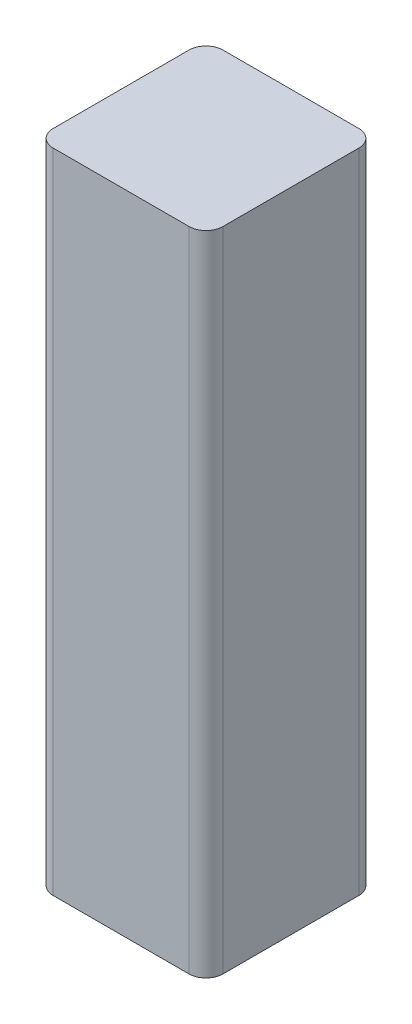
from build123d import *

# Parameters (mm, degrees)
ESQUISSE1_W        = 80
ESQUISSE1_H        = 80
BOSS_EXTRU_1_DEPTH = 305
CONG_1_R           = 8


with BuildPart() as part:
    # Esquisse1 → Boss.-Extru.1 (new body)
    with BuildSketch(Plane(origin=(0, 0, 0), x_dir=(1, 0, 0), z_dir=(0, 1, 0))):
        Rectangle(ESQUISSE1_W, ESQUISSE1_H)
    extrude(amount=BOSS_EXTRU_1_DEPTH)

    # Cong_1
    cong_1_edges = [part.edges().sort_by_distance(p)[0] for p in [
        (40, 152.5, 40),
        (-40, 152.5, 40),
        (-40, 152.5, -40),
        (40, 152.5, -40),
    ]]
    fillet(cong_1_edges, radius=CONG_1_R)


solid = part.part
